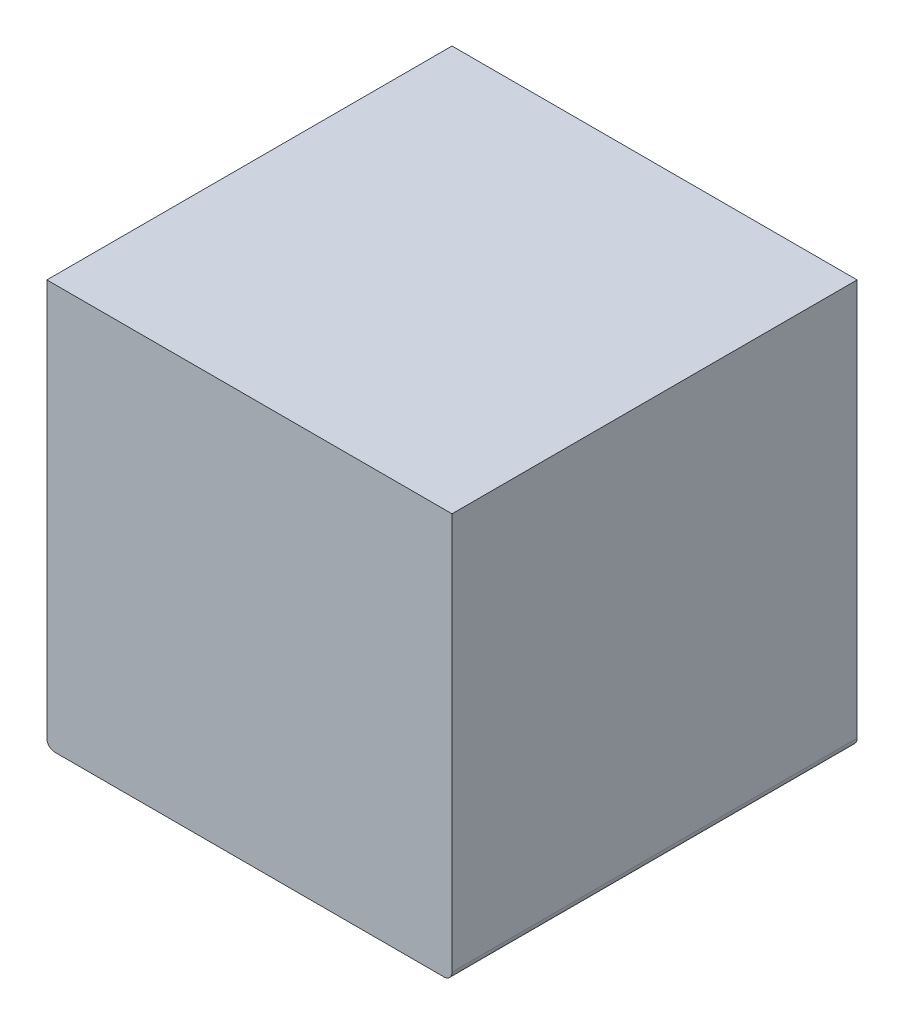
from build123d import *

# Parameters (mm, degrees)
SKETCH1_W           = 100
SKETCH1_H           = 100
BOSS_EXTRUDE1_DEPTH = 100
FILLET1_R           = 2


with BuildPart() as part:
    # Sketch1 → Boss-Extrude1 (new body)
    with BuildSketch(Plane(origin=(0, 0, 0), x_dir=(1, 0, 0), z_dir=(0, 1, 0))):
        Rectangle(SKETCH1_W, SKETCH1_H)
    extrude(amount=BOSS_EXTRUDE1_DEPTH)

    # Fillet1
    fillet1_edges = [part.edges().sort_by_distance(p)[0] for p in [
        (50, 0, 0),
        (-50, 0, 0),
    ]]
    fillet(fillet1_edges, radius=FILLET1_R)


solid = part.part
